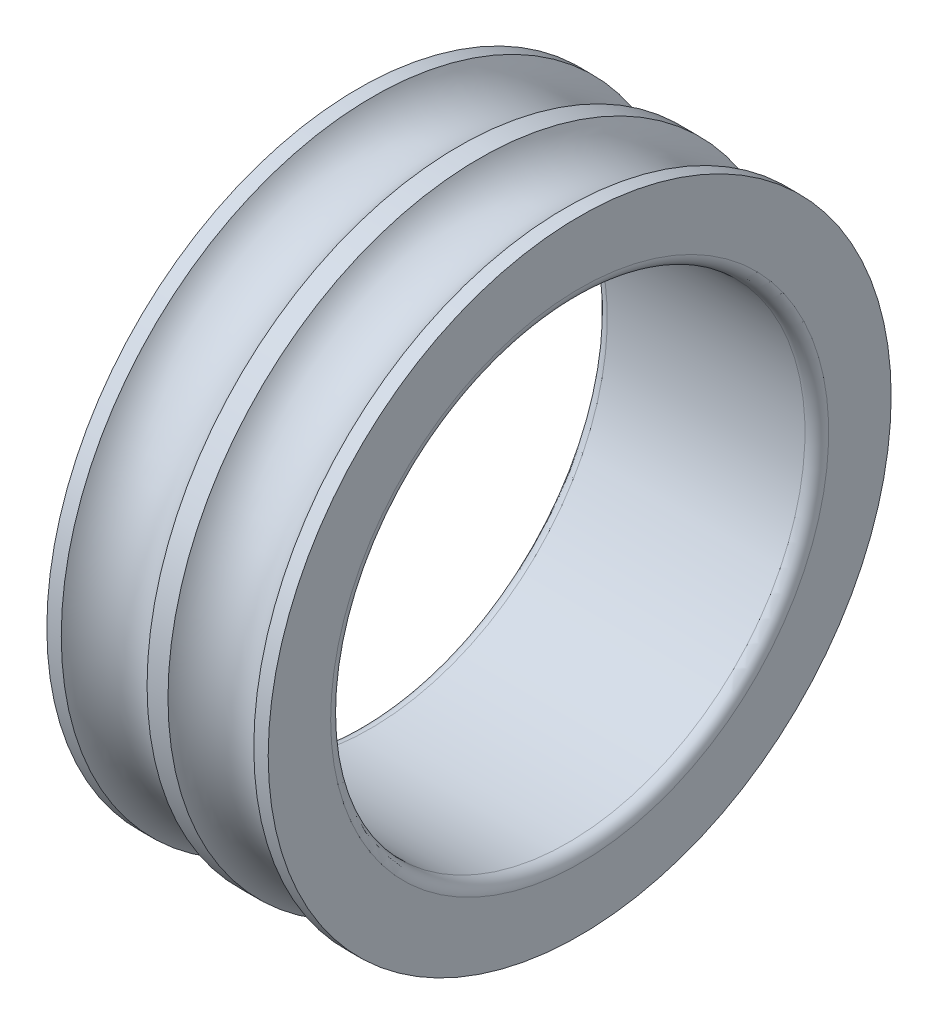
from build123d import *


with BuildPart() as part:
    # Esquisse1 → Base-R_volution (revolve)
    with BuildSketch(Plane(origin=(0, 0, 0), x_dir=(1, 0, 0), z_dir=(0, 1, 0)), mode=Mode.PRIVATE) as base_r_volution_sk:
        with BuildLine():
            Line((0, 39.4), (0, 31.5))
            ThreePointArc((0, 31.5), (0.439339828, 30.439339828), (1.5, 30))
            Line((1.5, 30), (26.5, 30))
            ThreePointArc((26.5, 30), (27.560660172, 30.439339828), (28, 31.5))
            Line((28, 31.5), (28, 39.4))
            Line((28, 39.4), (26.177015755, 39.4))
            ThreePointArc((26.177015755, 39.4), (20.75, 36.25), (15.322984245, 39.4))
            Line((15.322984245, 39.4), (12.677015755, 39.4))
            ThreePointArc((12.677015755, 39.4), (7.25, 36.25), (1.822984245, 39.4))
            Line((1.822984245, 39.4), (0, 39.4))
        make_face()
    revolve(base_r_volution_sk.sketch.rotate(Axis((0, 0, 0), (1, 0, 0)), 180), axis=Axis((0, 0, 0), (1, 0, 0)))


solid = part.part
